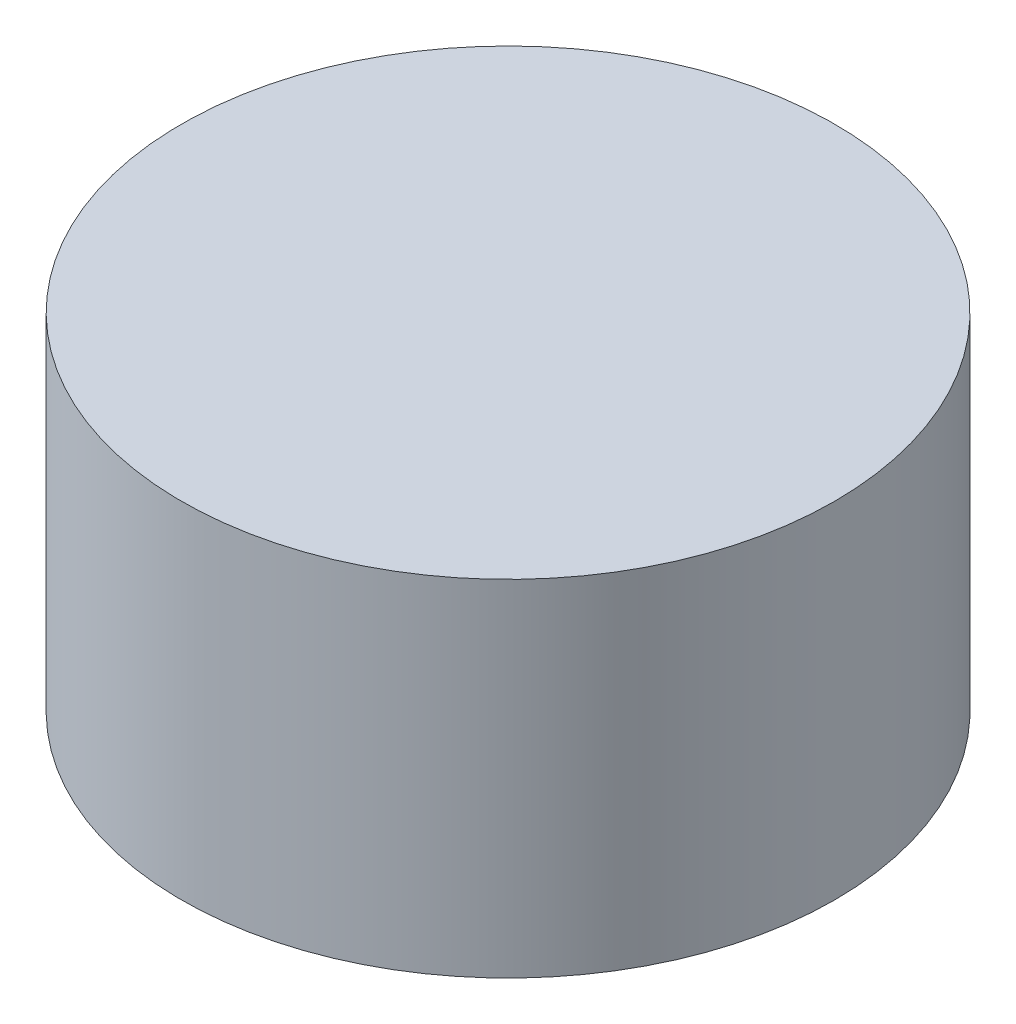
ISO-10303-21;
HEADER;
FILE_DESCRIPTION(('STEP AP214'),'2;1');
FILE_NAME('part.step','',(''),(''),'','','');
FILE_SCHEMA(('AUTOMOTIVE_DESIGN { 1 0 10303 214 1 1 1 1 }'));
ENDSEC;
DATA;
#1=APPLICATION_CONTEXT('core data for automotive mechanical design processes');
#2=APPLICATION_PROTOCOL_DEFINITION('international standard','automotive_design',2000,#1);
#3=PRODUCT_CONTEXT('',#1,'mechanical');
#4=PRODUCT('Part','Part','',(#3));
#5=PRODUCT_RELATED_PRODUCT_CATEGORY('part','',(#4));
#6=PRODUCT_DEFINITION_FORMATION('','',#4);
#7=PRODUCT_DEFINITION_CONTEXT('part definition',#1,'design');
#8=PRODUCT_DEFINITION('design','',#6,#7);
#9=PRODUCT_DEFINITION_SHAPE('','',#8);
#10=(LENGTH_UNIT() NAMED_UNIT(*) SI_UNIT(.MILLI.,.METRE.));
#11=(NAMED_UNIT(*) PLANE_ANGLE_UNIT() SI_UNIT($,.RADIAN.));
#12=(NAMED_UNIT(*) SI_UNIT($,.STERADIAN.) SOLID_ANGLE_UNIT());
#13=UNCERTAINTY_MEASURE_WITH_UNIT(LENGTH_MEASURE(1.E-05),#10,'distance_accuracy_value','');
#14=(GEOMETRIC_REPRESENTATION_CONTEXT(3) GLOBAL_UNCERTAINTY_ASSIGNED_CONTEXT((#13)) GLOBAL_UNIT_ASSIGNED_CONTEXT((#10,
#11,#12)) REPRESENTATION_CONTEXT('',''));
#15=CARTESIAN_POINT('',(0.,0.,0.));
#16=DIRECTION('',(0.,0.,1.));
#17=DIRECTION('',(1.,0.,0.));
#18=AXIS2_PLACEMENT_3D('',#15,#16,#17);
#19=CARTESIAN_POINT('',(-1.75,1.85,0.));
#20=DIRECTION('',(0.,-1.,0.));
#21=DIRECTION('',(1.,0.,0.));
#22=AXIS2_PLACEMENT_3D('',#19,#20,#21);
#23=PLANE('',#22);
#24=CARTESIAN_POINT('',(0.,1.85,0.));
#25=DIRECTION('',(0.,-1.,0.));
#26=DIRECTION('',(1.,0.,0.));
#27=AXIS2_PLACEMENT_3D('',#24,#25,#26);
#28=CIRCLE('',#27,1.75);
#29=CARTESIAN_POINT('',(1.75,1.85,0.));
#30=VERTEX_POINT('',#29);
#31=EDGE_CURVE('E11',#30,#30,#28,.T.);
#32=ORIENTED_EDGE('',*,*,#31,.F.);
#33=EDGE_LOOP('',(#32));
#34=FACE_BOUND('',#33,.T.);
#35=ADVANCED_FACE('F31',(#34),#23,.F.);
#36=CARTESIAN_POINT('',(0.,0.,0.));
#37=DIRECTION('',(0.,-1.,0.));
#38=DIRECTION('',(1.,0.,0.));
#39=AXIS2_PLACEMENT_3D('',#36,#37,#38);
#40=CYLINDRICAL_SURFACE('',#39,1.75);
#41=CARTESIAN_POINT('',(0.,0.,0.));
#42=DIRECTION('',(0.,-1.,0.));
#43=DIRECTION('',(1.,0.,0.));
#44=AXIS2_PLACEMENT_3D('',#41,#42,#43);
#45=CIRCLE('',#44,1.75);
#46=CARTESIAN_POINT('',(1.75,0.,0.));
#47=VERTEX_POINT('',#46);
#48=EDGE_CURVE('E37',#47,#47,#45,.T.);
#49=ORIENTED_EDGE('',*,*,#48,.F.);
#50=EDGE_LOOP('',(#49));
#51=FACE_BOUND('',#50,.T.);
#52=ORIENTED_EDGE('',*,*,#31,.T.);
#53=EDGE_LOOP('',(#52));
#54=FACE_BOUND('',#53,.T.);
#55=ADVANCED_FACE('F61',(#51,#54),#40,.T.);
#56=CARTESIAN_POINT('',(-1.5,0.,0.));
#57=DIRECTION('',(0.,1.,0.));
#58=DIRECTION('',(-1.,0.,0.));
#59=AXIS2_PLACEMENT_3D('',#56,#57,#58);
#60=PLANE('',#59);
#61=CARTESIAN_POINT('',(0.,0.,0.));
#62=DIRECTION('',(0.,-1.,0.));
#63=DIRECTION('',(1.,0.,0.));
#64=AXIS2_PLACEMENT_3D('',#61,#62,#63);
#65=CIRCLE('',#64,1.5);
#66=CARTESIAN_POINT('',(1.5,0.,0.));
#67=VERTEX_POINT('',#66);
#68=EDGE_CURVE('E52',#67,#67,#65,.T.);
#69=ORIENTED_EDGE('',*,*,#68,.F.);
#70=EDGE_LOOP('',(#69));
#71=FACE_BOUND('',#70,.T.);
#72=ORIENTED_EDGE('',*,*,#48,.T.);
#73=EDGE_LOOP('',(#72));
#74=FACE_BOUND('',#73,.T.);
#75=ADVANCED_FACE('F59',(#71,#74),#60,.F.);
#76=CARTESIAN_POINT('',(0.,0.,0.));
#77=DIRECTION('',(0.,-1.,0.));
#78=DIRECTION('',(1.,0.,0.));
#79=AXIS2_PLACEMENT_3D('',#76,#77,#78);
#80=CYLINDRICAL_SURFACE('',#79,1.5);
#81=CARTESIAN_POINT('',(0.,0.75,0.));
#82=DIRECTION('',(0.,-1.,0.));
#83=DIRECTION('',(1.,0.,0.));
#84=AXIS2_PLACEMENT_3D('',#81,#82,#83);
#85=CIRCLE('',#84,1.5);
#86=CARTESIAN_POINT('',(1.5,0.75,0.));
#87=VERTEX_POINT('',#86);
#88=EDGE_CURVE('E49',#87,#87,#85,.T.);
#89=ORIENTED_EDGE('',*,*,#88,.F.);
#90=EDGE_LOOP('',(#89));
#91=FACE_BOUND('',#90,.T.);
#92=ORIENTED_EDGE('',*,*,#68,.T.);
#93=EDGE_LOOP('',(#92));
#94=FACE_BOUND('',#93,.T.);
#95=ADVANCED_FACE('F79',(#91,#94),#80,.F.);
#96=CARTESIAN_POINT('',(-1.5,0.75,0.));
#97=DIRECTION('',(0.,1.,0.));
#98=DIRECTION('',(-1.,0.,0.));
#99=AXIS2_PLACEMENT_3D('',#96,#97,#98);
#100=PLANE('',#99);
#101=CARTESIAN_POINT('',(0.,0.75,0.));
#102=DIRECTION('',(0.,-1.,0.));
#103=DIRECTION('',(1.,0.,0.));
#104=AXIS2_PLACEMENT_3D('',#101,#102,#103);
#105=CIRCLE('',#104,1.);
#106=CARTESIAN_POINT('',(1.,0.75,0.));
#107=VERTEX_POINT('',#106);
#108=EDGE_CURVE('E47',#107,#107,#105,.T.);
#109=ORIENTED_EDGE('',*,*,#108,.F.);
#110=EDGE_LOOP('',(#109));
#111=FACE_BOUND('',#110,.T.);
#112=ORIENTED_EDGE('',*,*,#88,.T.);
#113=EDGE_LOOP('',(#112));
#114=FACE_BOUND('',#113,.T.);
#115=ADVANCED_FACE('F43',(#111,#114),#100,.F.);
#116=CARTESIAN_POINT('',(0.,0.75,0.));
#117=DIRECTION('',(0.,-1.,0.));
#118=DIRECTION('',(1.,0.,0.));
#119=AXIS2_PLACEMENT_3D('',#116,#117,#118);
#120=CONICAL_SURFACE('',#119,1.,1.0471975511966);
#121=CARTESIAN_POINT('',(0.,1.32735026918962,0.));
#122=VERTEX_POINT('',#121);
#123=VERTEX_LOOP('',#122);
#124=FACE_BOUND('',#123,.T.);
#125=ORIENTED_EDGE('',*,*,#108,.T.);
#126=EDGE_LOOP('',(#125));
#127=FACE_BOUND('',#126,.T.);
#128=ADVANCED_FACE('F40',(#124,#127),#120,.F.);
#129=CLOSED_SHELL('',(#35,#55,#75,#95,#115,#128));
#130=MANIFOLD_SOLID_BREP('B2',#129);
#131=ADVANCED_BREP_SHAPE_REPRESENTATION('',(#18,#130),#14);
#132=SHAPE_DEFINITION_REPRESENTATION(#9,#131);
ENDSEC;
END-ISO-10303-21;
